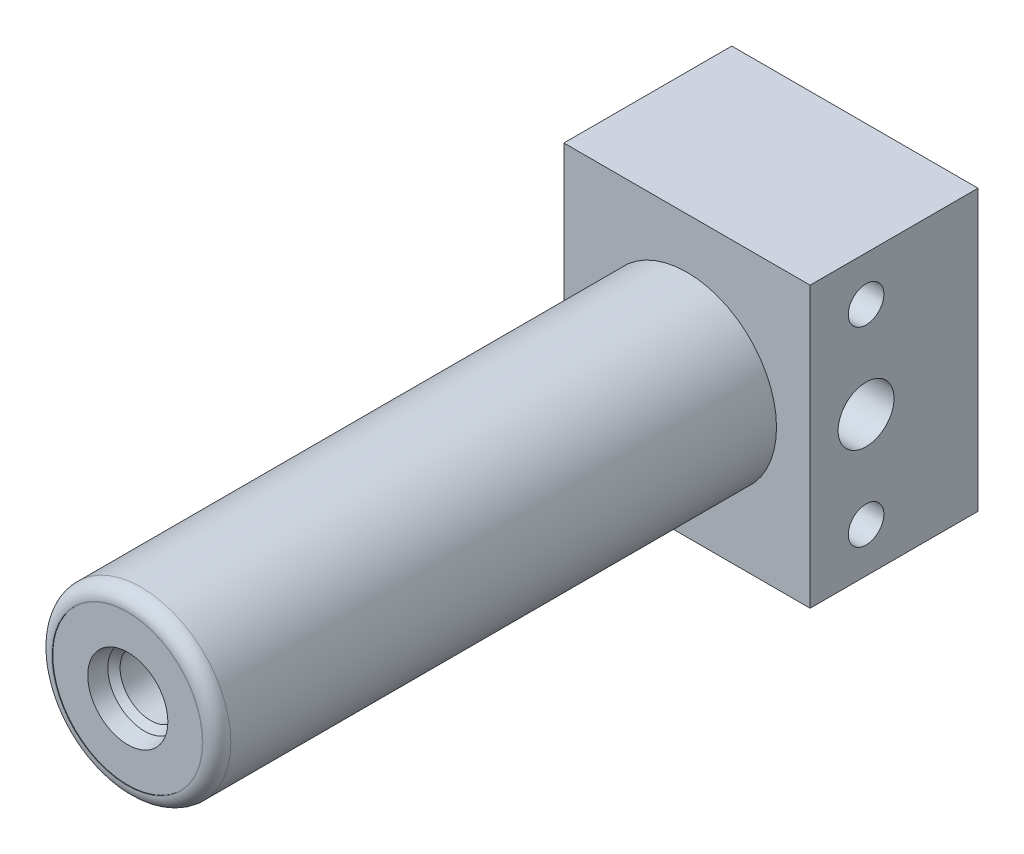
ISO-10303-21;
HEADER;
FILE_DESCRIPTION(('STEP AP214'),'2;1');
FILE_NAME('part.step','',(''),(''),'','','');
FILE_SCHEMA(('AUTOMOTIVE_DESIGN { 1 0 10303 214 1 1 1 1 }'));
ENDSEC;
DATA;
#1=APPLICATION_CONTEXT('core data for automotive mechanical design processes');
#2=APPLICATION_PROTOCOL_DEFINITION('international standard','automotive_design',2000,#1);
#3=PRODUCT_CONTEXT('',#1,'mechanical');
#4=PRODUCT('Part','Part','',(#3));
#5=PRODUCT_RELATED_PRODUCT_CATEGORY('part','',(#4));
#6=PRODUCT_DEFINITION_FORMATION('','',#4);
#7=PRODUCT_DEFINITION_CONTEXT('part definition',#1,'design');
#8=PRODUCT_DEFINITION('design','',#6,#7);
#9=PRODUCT_DEFINITION_SHAPE('','',#8);
#10=(LENGTH_UNIT() NAMED_UNIT(*) SI_UNIT(.MILLI.,.METRE.));
#11=(NAMED_UNIT(*) PLANE_ANGLE_UNIT() SI_UNIT($,.RADIAN.));
#12=(NAMED_UNIT(*) SI_UNIT($,.STERADIAN.) SOLID_ANGLE_UNIT());
#13=UNCERTAINTY_MEASURE_WITH_UNIT(LENGTH_MEASURE(1.E-05),#10,'distance_accuracy_value','');
#14=(GEOMETRIC_REPRESENTATION_CONTEXT(3) GLOBAL_UNCERTAINTY_ASSIGNED_CONTEXT((#13)) GLOBAL_UNIT_ASSIGNED_CONTEXT((#10,
#11,#12)) REPRESENTATION_CONTEXT('',''));
#15=CARTESIAN_POINT('',(0.,0.,0.));
#16=DIRECTION('',(0.,0.,1.));
#17=DIRECTION('',(1.,0.,0.));
#18=AXIS2_PLACEMENT_3D('',#15,#16,#17);
#19=CARTESIAN_POINT('',(-1.27000000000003,0.,12.7));
#20=DIRECTION('',(1.,0.,0.));
#21=DIRECTION('',(0.,0.,-1.));
#22=AXIS2_PLACEMENT_3D('',#19,#20,#21);
#23=CYLINDRICAL_SURFACE('',#22,2.38125);
#24=CARTESIAN_POINT('',(5.71499999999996,0.,10.31875));
#25=CARTESIAN_POINT('',(5.71499259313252,0.12756449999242,10.3187597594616));
#26=CARTESIAN_POINT('',(5.71068086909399,0.255313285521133,10.3290587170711));
#27=CARTESIAN_POINT('',(5.69385664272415,0.507198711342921,10.369879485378));
#28=CARTESIAN_POINT('',(5.68132274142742,0.631325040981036,10.4004540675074));
#29=CARTESIAN_POINT('',(5.64939751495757,0.871897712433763,10.4805053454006));
#30=CARTESIAN_POINT('',(5.63002943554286,0.988368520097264,10.5299180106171));
#31=CARTESIAN_POINT('',(5.58632265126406,1.21125550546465,10.6459773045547));
#32=CARTESIAN_POINT('',(5.56198545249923,1.31767471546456,10.7126187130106));
#33=CARTESIAN_POINT('',(5.50940914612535,1.52294926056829,10.864778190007));
#34=CARTESIAN_POINT('',(5.4810422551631,1.62123362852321,10.9510219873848));
#35=CARTESIAN_POINT('',(5.42415819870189,1.80243444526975,11.1384035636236));
#36=CARTESIAN_POINT('',(5.39564096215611,1.88534280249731,11.2395491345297));
#37=CARTESIAN_POINT('',(5.34011546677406,2.03746870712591,11.4598960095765));
#38=CARTESIAN_POINT('',(5.31325049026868,2.10581192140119,11.579740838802));
#39=CARTESIAN_POINT('',(5.26609765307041,2.22111456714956,11.8305070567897));
#40=CARTESIAN_POINT('',(5.24580640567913,2.26808501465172,11.9614226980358));
#41=CARTESIAN_POINT('',(5.21548148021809,2.33695109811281,12.2240427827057));
#42=CARTESIAN_POINT('',(5.20500078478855,2.35994558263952,12.3554054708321));
#43=CARTESIAN_POINT('',(5.19419826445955,2.38363524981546,12.6205106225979));
#44=CARTESIAN_POINT('',(5.19387083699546,2.38434273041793,12.7542517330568));
#45=CARTESIAN_POINT('',(5.20303352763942,2.36426597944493,13.0093721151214));
#46=CARTESIAN_POINT('',(5.21177296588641,2.34512512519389,13.1309130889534));
#47=CARTESIAN_POINT('',(5.23681609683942,2.28865158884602,13.3688685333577));
#48=CARTESIAN_POINT('',(5.25312123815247,2.25131542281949,13.4852820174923));
#49=CARTESIAN_POINT('',(5.29182681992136,2.15878331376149,13.7126174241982));
#50=CARTESIAN_POINT('',(5.31434958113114,2.1032242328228,13.8233697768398));
#51=CARTESIAN_POINT('',(5.36292420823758,1.9760801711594,14.0344100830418));
#52=CARTESIAN_POINT('',(5.38897746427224,1.90448887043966,14.1346938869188));
#53=CARTESIAN_POINT('',(5.4443562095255,1.74020981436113,14.330870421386));
#54=CARTESIAN_POINT('',(5.47377216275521,1.64625048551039,14.4256758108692));
#55=CARTESIAN_POINT('',(5.53070407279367,1.44347487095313,14.5985487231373));
#56=CARTESIAN_POINT('',(5.558219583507,1.33465511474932,14.6766123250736));
#57=CARTESIAN_POINT('',(5.60904930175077,1.10194334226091,14.815380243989));
#58=CARTESIAN_POINT('',(5.6322518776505,0.977761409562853,14.8756422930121));
#59=CARTESIAN_POINT('',(5.670984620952,0.719808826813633,14.9740387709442));
#60=CARTESIAN_POINT('',(5.68651902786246,0.586043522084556,15.012185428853));
#61=CARTESIAN_POINT('',(5.7073731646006,0.32180805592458,15.0629924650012));
#62=CARTESIAN_POINT('',(5.71327675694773,0.191664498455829,15.0771120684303));
#63=CARTESIAN_POINT('',(5.71606775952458,-0.0692556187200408,15.0838145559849));
#64=CARTESIAN_POINT('',(5.71295775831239,-0.20003198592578,15.0764036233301));
#65=CARTESIAN_POINT('',(5.69844969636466,-0.451672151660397,15.0413000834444));
#66=CARTESIAN_POINT('',(5.68747060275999,-0.572705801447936,15.0146322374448));
#67=CARTESIAN_POINT('',(5.65877595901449,-0.808449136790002,14.9431980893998));
#68=CARTESIAN_POINT('',(5.64105955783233,-0.92315802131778,14.8984295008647));
#69=CARTESIAN_POINT('',(5.59990505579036,-1.14701764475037,14.7906022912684));
#70=CARTESIAN_POINT('',(5.57630631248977,-1.25588503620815,14.7270187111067));
#71=CARTESIAN_POINT('',(5.5259059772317,-1.46179454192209,14.5839433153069));
#72=CARTESIAN_POINT('',(5.49910304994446,-1.55883169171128,14.504444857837));
#73=CARTESIAN_POINT('',(5.44281527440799,-1.74561518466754,14.3251493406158));
#74=CARTESIAN_POINT('',(5.41327565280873,-1.83434487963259,14.2243076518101));
#75=CARTESIAN_POINT('',(5.35656161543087,-1.99390605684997,14.0086944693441));
#76=CARTESIAN_POINT('',(5.32938773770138,-2.06473347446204,13.8939198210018));
#77=CARTESIAN_POINT('',(5.28030540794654,-2.18724404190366,13.6513299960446));
#78=CARTESIAN_POINT('',(5.25847746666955,-2.23864014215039,13.5233523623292));
#79=CARTESIAN_POINT('',(5.22366917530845,-2.31871673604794,13.2593640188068));
#80=CARTESIAN_POINT('',(5.2106815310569,-2.34741596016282,13.1233600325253));
#81=CARTESIAN_POINT('',(5.19613828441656,-2.37942272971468,12.8584603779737));
#82=CARTESIAN_POINT('',(5.19377963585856,-2.38451479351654,12.7298234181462));
#83=CARTESIAN_POINT('',(5.19862789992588,-2.37392671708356,12.4736043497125));
#84=CARTESIAN_POINT('',(5.20583334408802,-2.35824976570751,12.3460220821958));
#85=CARTESIAN_POINT('',(5.22826395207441,-2.30806759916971,12.1016533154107));
#86=CARTESIAN_POINT('',(5.24310015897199,-2.27447286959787,11.9846407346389));
#87=CARTESIAN_POINT('',(5.27881560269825,-2.19029909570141,11.7578860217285));
#88=CARTESIAN_POINT('',(5.29969653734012,-2.13971527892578,11.6481459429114));
#89=CARTESIAN_POINT('',(5.34670548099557,-2.01949577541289,11.4318493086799));
#90=CARTESIAN_POINT('',(5.37307349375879,-1.94889741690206,11.3258809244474));
#91=CARTESIAN_POINT('',(5.42741528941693,-1.79200381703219,11.1267364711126));
#92=CARTESIAN_POINT('',(5.45538962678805,-1.70570313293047,11.0335648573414));
#93=CARTESIAN_POINT('',(5.51223923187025,-1.5123807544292,10.8556766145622));
#94=CARTESIAN_POINT('',(5.54103172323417,-1.40430768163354,10.7720700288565));
#95=CARTESIAN_POINT('',(5.59422593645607,-1.1746333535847,10.6241231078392));
#96=CARTESIAN_POINT('',(5.61862565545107,-1.05302596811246,10.5597915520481));
#97=CARTESIAN_POINT('',(5.65992920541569,-0.801457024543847,10.4536031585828));
#98=CARTESIAN_POINT('',(5.67695027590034,-0.671666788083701,10.4113923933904));
#99=CARTESIAN_POINT('',(5.6958071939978,-0.472734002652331,10.3651502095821));
#100=CARTESIAN_POINT('',(5.70097875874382,-0.405776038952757,10.3525853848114));
#101=CARTESIAN_POINT('',(5.70897329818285,-0.270902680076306,10.333232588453));
#102=CARTESIAN_POINT('',(5.71179782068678,-0.202987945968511,10.3264408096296));
#103=CARTESIAN_POINT('',(5.71446939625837,-0.089993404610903,10.3200239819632));
#104=CARTESIAN_POINT('',(5.71500261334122,-0.0450081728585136,10.3187465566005));
#105=CARTESIAN_POINT('',(5.71499999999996,0.,10.31875));
#106=B_SPLINE_CURVE_WITH_KNOTS('',3,(#24,#25,#26,#27,#28,#29,#30,#31,#32,#33,#34,#35,#36,#37,
#38,#39,#40,#41,#42,#43,#44,#45,#46,#47,#48,#49,#50,#51,#52,#53,#54,#55,#56,#57,#58,#59,#60,#61,
#62,#63,#64,#65,#66,#67,#68,#69,#70,#71,#72,#73,#74,#75,#76,#77,#78,#79,#80,#81,#82,#83,#84,#85,
#86,#87,#88,#89,#90,#91,#92,#93,#94,#95,#96,#97,#98,#99,#100,#101,#102,#103,#104,#105),
.UNSPECIFIED.,.T.,.F.,(4,2,2,2,2,2,2,2,2,2,2,2,2,2,2,2,2,2,2,2,2,2,2,2,2,2,2,2,2,2,2,2,2,2,2,2,
2,2,2,2,4),(0.,0.382537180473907,0.766073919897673,1.14831847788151,1.53044735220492,
1.93010668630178,2.32997574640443,2.74951935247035,3.1688464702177,3.56797495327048,
3.96688319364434,4.33521149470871,4.7036103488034,5.07984848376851,5.45623519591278,
5.86443088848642,6.2727220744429,6.6904372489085,7.10792122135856,7.49900284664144,
7.88997217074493,8.2615390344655,8.63315284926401,9.01631042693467,9.3996282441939,
9.81034019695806,10.2211453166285,10.6378017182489,11.0541139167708,11.4383796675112,
11.8225864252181,12.1889072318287,12.5553310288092,12.9437871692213,13.3323782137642,
13.7492714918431,14.1663543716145,14.5765429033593,14.7812766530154,14.985875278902,
15.1208446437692),.UNSPECIFIED.);
#107=CARTESIAN_POINT('',(5.71499999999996,0.,10.31875));
#108=VERTEX_POINT('',#107);
#109=EDGE_CURVE('E158',#108,#108,#106,.T.);
#110=ORIENTED_EDGE('',*,*,#109,.F.);
#111=EDGE_LOOP('',(#110));
#112=FACE_BOUND('',#111,.T.);
#113=CARTESIAN_POINT('',(6.34999999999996,0.,12.7));
#114=DIRECTION('',(1.,0.,0.));
#115=DIRECTION('',(0.,0.,-1.));
#116=AXIS2_PLACEMENT_3D('',#113,#114,#115);
#117=CIRCLE('',#116,2.38125);
#118=CARTESIAN_POINT('',(6.34999999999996,0.,10.31875));
#119=VERTEX_POINT('',#118);
#120=EDGE_CURVE('E38',#119,#119,#117,.F.);
#121=ORIENTED_EDGE('',*,*,#120,.F.);
#122=EDGE_LOOP('',(#121));
#123=FACE_BOUND('',#122,.T.);
#124=ADVANCED_FACE('F34',(#112,#123),#23,.F.);
#125=CARTESIAN_POINT('',(0.,0.,57.1499999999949));
#126=DIRECTION('',(0.,0.,1.));
#127=DIRECTION('',(1.,0.,0.));
#128=AXIS2_PLACEMENT_3D('',#125,#126,#127);
#129=CYLINDRICAL_SURFACE('',#128,3.4544);
#130=CARTESIAN_POINT('',(0.,0.,79.9211));
#131=DIRECTION('',(0.,0.,1.));
#132=DIRECTION('',(1.,0.,0.));
#133=AXIS2_PLACEMENT_3D('',#130,#131,#132);
#134=CIRCLE('',#133,3.4544);
#135=CARTESIAN_POINT('',(3.45439999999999,0.,79.9211));
#136=VERTEX_POINT('',#135);
#137=EDGE_CURVE('E161',#136,#136,#134,.T.);
#138=ORIENTED_EDGE('',*,*,#137,.T.);
#139=EDGE_LOOP('',(#138));
#140=FACE_BOUND('',#139,.T.);
#141=CARTESIAN_POINT('',(0.,0.,60.96));
#142=DIRECTION('',(0.,0.,-1.));
#143=DIRECTION('',(-1.,0.,0.));
#144=AXIS2_PLACEMENT_3D('',#141,#142,#143);
#145=CIRCLE('',#144,3.4544);
#146=CARTESIAN_POINT('',(-3.4544,0.,60.96));
#147=VERTEX_POINT('',#146);
#148=EDGE_CURVE('E172',#147,#147,#145,.T.);
#149=ORIENTED_EDGE('',*,*,#148,.T.);
#150=EDGE_LOOP('',(#149));
#151=FACE_BOUND('',#150,.T.);
#152=CARTESIAN_POINT('',(-3.4544,0.,68.42125));
#153=CARTESIAN_POINT('',(-3.45439900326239,-0.118789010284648,68.4212487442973));
#154=CARTESIAN_POINT('',(-3.44821958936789,-0.237583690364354,68.4123105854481));
#155=CARTESIAN_POINT('',(-3.42411041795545,-0.471357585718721,68.3771276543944));
#156=CARTESIAN_POINT('',(-3.40617494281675,-0.586334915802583,68.3508744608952));
#157=CARTESIAN_POINT('',(-3.36030887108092,-0.808732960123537,68.2827166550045));
#158=CARTESIAN_POINT('',(-3.33242679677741,-0.916187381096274,68.2408879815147));
#159=CARTESIAN_POINT('',(-3.26886612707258,-1.1220592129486,68.1434072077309));
#160=CARTESIAN_POINT('',(-3.23318648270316,-1.22047540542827,68.0877532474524));
#161=CARTESIAN_POINT('',(-3.15311607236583,-1.41519041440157,67.9589542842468));
#162=CARTESIAN_POINT('',(-3.10823678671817,-1.51055460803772,67.8847065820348));
#163=CARTESIAN_POINT('',(-3.01537225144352,-1.68834049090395,67.7235332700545));
#164=CARTESIAN_POINT('',(-2.96738246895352,-1.77074266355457,67.636588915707));
#165=CARTESIAN_POINT('',(-2.86373167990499,-1.93463831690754,67.4353970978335));
#166=CARTESIAN_POINT('',(-2.80815510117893,-2.01359044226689,67.3190212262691));
#167=CARTESIAN_POINT('',(-2.70448941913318,-2.15081441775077,67.071636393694));
#168=CARTESIAN_POINT('',(-2.65638765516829,-2.20912145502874,66.9406528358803));
#169=CARTESIAN_POINT('',(-2.58845427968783,-2.28793091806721,66.7077486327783));
#170=CARTESIAN_POINT('',(-2.56447430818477,-2.31453836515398,66.6091178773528));
#171=CARTESIAN_POINT('',(-2.52739170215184,-2.35498172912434,66.4073587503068));
#172=CARTESIAN_POINT('',(-2.51426867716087,-2.36884159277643,66.3042391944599));
#173=CARTESIAN_POINT('',(-2.50095285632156,-2.38290235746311,66.0956605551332));
#174=CARTESIAN_POINT('',(-2.50082696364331,-2.38303258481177,65.9901921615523));
#175=CARTESIAN_POINT('',(-2.51370298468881,-2.36944117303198,65.7809398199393));
#176=CARTESIAN_POINT('',(-2.52671424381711,-2.35570967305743,65.6771571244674));
#177=CARTESIAN_POINT('',(-2.56261849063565,-2.31657191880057,65.4802244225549));
#178=CARTESIAN_POINT('',(-2.58488788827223,-2.29189677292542,65.3868077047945));
#179=CARTESIAN_POINT('',(-2.63656720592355,-2.23225222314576,65.2054147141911));
#180=CARTESIAN_POINT('',(-2.66598273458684,-2.19727472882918,65.1174427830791));
#181=CARTESIAN_POINT('',(-2.74552930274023,-2.09780365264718,64.9044056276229));
#182=CARTESIAN_POINT('',(-2.7985916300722,-2.02734305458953,64.78320568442));
#183=CARTESIAN_POINT('',(-2.90788667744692,-1.86722019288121,64.5556661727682));
#184=CARTESIAN_POINT('',(-2.96412539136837,-1.77752066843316,64.4493561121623));
#185=CARTESIAN_POINT('',(-3.07443020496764,-1.57916895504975,64.2521763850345));
#186=CARTESIAN_POINT('',(-3.12846877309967,-1.4703352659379,64.1614727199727));
#187=CARTESIAN_POINT('',(-3.22828277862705,-1.2358109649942,63.9995759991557));
#188=CARTESIAN_POINT('',(-3.27407527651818,-1.11015611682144,63.9283424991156));
#189=CARTESIAN_POINT('',(-3.34372957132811,-0.874058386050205,63.8220687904));
#190=CARTESIAN_POINT('',(-3.37020272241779,-0.766420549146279,63.782505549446));
#191=CARTESIAN_POINT('',(-3.41304858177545,-0.544693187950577,63.7190245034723));
#192=CARTESIAN_POINT('',(-3.42942814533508,-0.430608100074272,63.6950960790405));
#193=CARTESIAN_POINT('',(-3.45065568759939,-0.198648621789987,63.6641579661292));
#194=CARTESIAN_POINT('',(-3.45546120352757,-0.0807618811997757,63.6572105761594));
#195=CARTESIAN_POINT('',(-3.45294408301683,0.154611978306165,63.6608620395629));
#196=CARTESIAN_POINT('',(-3.44562134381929,0.272099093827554,63.6714610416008));
#197=CARTESIAN_POINT('',(-3.42033463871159,0.496151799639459,63.7084068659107));
#198=CARTESIAN_POINT('',(-3.40302011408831,0.602953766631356,63.7337934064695));
#199=CARTESIAN_POINT('',(-3.35966126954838,0.810431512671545,63.7982676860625));
#200=CARTESIAN_POINT('',(-3.33361533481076,0.911106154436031,63.8373579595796));
#201=CARTESIAN_POINT('',(-3.27234689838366,1.11197083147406,63.9311883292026));
#202=CARTESIAN_POINT('',(-3.23657607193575,1.21153845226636,63.9868945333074));
#203=CARTESIAN_POINT('',(-3.15950328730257,1.40029735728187,64.1106790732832));
#204=CARTESIAN_POINT('',(-3.11819745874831,1.48948129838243,64.1787660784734));
#205=CARTESIAN_POINT('',(-3.02541277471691,1.67087000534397,64.3383776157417));
#206=CARTESIAN_POINT('',(-2.97339606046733,1.7610263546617,64.4319186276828));
#207=CARTESIAN_POINT('',(-2.86983245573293,1.92519094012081,64.6325866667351));
#208=CARTESIAN_POINT('',(-2.81828586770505,1.9991893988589,64.7397218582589));
#209=CARTESIAN_POINT('',(-2.72692094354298,2.12176854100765,64.952944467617));
#210=CARTESIAN_POINT('',(-2.6864379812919,2.17233929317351,65.0575969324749));
#211=CARTESIAN_POINT('',(-2.61456388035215,2.25833747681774,65.2758321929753));
#212=CARTESIAN_POINT('',(-2.58315489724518,2.29379469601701,65.3893968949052));
#213=CARTESIAN_POINT('',(-2.5387865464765,2.34272029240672,65.6022037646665));
#214=CARTESIAN_POINT('',(-2.52351240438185,2.3590127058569,65.7003011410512));
#215=CARTESIAN_POINT('',(-2.5045429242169,2.37914907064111,65.8988358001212));
#216=CARTESIAN_POINT('',(-2.50083513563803,2.38300640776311,65.9992704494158));
#217=CARTESIAN_POINT('',(-2.50558341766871,2.37801141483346,66.1995384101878));
#218=CARTESIAN_POINT('',(-2.51404211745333,2.36915633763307,66.2993715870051));
#219=CARTESIAN_POINT('',(-2.54179191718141,2.33935293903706,66.4957135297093));
#220=CARTESIAN_POINT('',(-2.56109859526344,2.31838722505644,66.5922173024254));
#221=CARTESIAN_POINT('',(-2.61517031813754,2.25740389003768,66.808549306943));
#222=CARTESIAN_POINT('',(-2.65285060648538,2.21353180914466,66.9265482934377));
#223=CARTESIAN_POINT('',(-2.73638887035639,2.10938564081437,67.1518988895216));
#224=CARTESIAN_POINT('',(-2.78225930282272,2.0490864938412,67.2592338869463));
#225=CARTESIAN_POINT('',(-2.87817707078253,1.91209775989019,67.4647086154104));
#226=CARTESIAN_POINT('',(-2.92829406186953,1.83507699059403,67.5625943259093));
#227=CARTESIAN_POINT('',(-3.02744479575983,1.66645012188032,67.7455187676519));
#228=CARTESIAN_POINT('',(-3.0764781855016,1.57483934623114,67.8305533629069));
#229=CARTESIAN_POINT('',(-3.17677142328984,1.36261588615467,67.9981945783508));
#230=CARTESIAN_POINT('',(-3.22723128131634,1.23971100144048,68.0784551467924));
#231=CARTESIAN_POINT('',(-3.29375053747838,1.04349526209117,68.1817145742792));
#232=CARTESIAN_POINT('',(-3.31439363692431,0.976120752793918,68.213276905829));
#233=CARTESIAN_POINT('',(-3.35201697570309,0.837849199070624,68.2702352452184));
#234=CARTESIAN_POINT('',(-3.3689986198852,0.766953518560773,68.2956336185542));
#235=CARTESIAN_POINT('',(-3.40662633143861,0.583581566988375,68.3515390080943));
#236=CARTESIAN_POINT('',(-3.42440239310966,0.469080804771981,68.3775552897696));
#237=CARTESIAN_POINT('',(-3.44828509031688,0.23638656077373,68.4124045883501));
#238=CARTESIAN_POINT('',(-3.45440099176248,0.11819608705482,68.421251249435));
#239=CARTESIAN_POINT('',(-3.4544,0.,68.42125));
#240=B_SPLINE_CURVE_WITH_KNOTS('',3,(#152,#153,#154,#155,#156,#157,#158,#159,#160,#161,#162,
#163,#164,#165,#166,#167,#168,#169,#170,#171,#172,#173,#174,#175,#176,#177,#178,#179,#180,#181,
#182,#183,#184,#185,#186,#187,#188,#189,#190,#191,#192,#193,#194,#195,#196,#197,#198,#199,#200,
#201,#202,#203,#204,#205,#206,#207,#208,#209,#210,#211,#212,#213,#214,#215,#216,#217,#218,#219,
#220,#221,#222,#223,#224,#225,#226,#227,#228,#229,#230,#231,#232,#233,#234,#235,#236,#237,#238,
#239),.UNSPECIFIED.,.T.,.F.,(4,2,2,2,2,2,2,2,2,2,2,2,2,2,2,2,2,2,2,2,2,2,2,2,2,2,2,2,2,2,2,2,2,
2,2,2,2,2,2,2,2,2,2,4),(0.,0.355900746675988,0.711974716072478,1.06633489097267,
1.42074276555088,1.80608526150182,2.19200251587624,2.6435984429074,3.09442092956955,
3.40801493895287,3.7210186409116,4.03563345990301,4.35047224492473,4.64686587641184,
4.9434928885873,5.3908420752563,5.83906561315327,6.29179603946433,6.74357876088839,
7.09518462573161,7.4465514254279,7.79920536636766,8.15186229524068,8.48383146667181,
8.81586206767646,9.17321282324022,9.53081477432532,9.94900619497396,10.3674499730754,
10.7353771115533,11.1025757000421,11.4030833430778,11.7032673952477,12.0035163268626,
12.304197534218,12.6962976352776,13.088999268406,13.4903339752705,13.8917975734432,
14.3544588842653,14.5857444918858,14.816941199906,15.1713472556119,15.5254715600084),.UNSPECIFIED.);
#241=CARTESIAN_POINT('',(-3.4544,0.,68.42125));
#242=VERTEX_POINT('',#241);
#243=EDGE_CURVE('E169',#242,#242,#240,.T.);
#244=ORIENTED_EDGE('',*,*,#243,.F.);
#245=EDGE_LOOP('',(#244));
#246=FACE_BOUND('',#245,.T.);
#247=ADVANCED_FACE('F251',(#140,#151,#246),#129,.F.);
#248=CARTESIAN_POINT('',(13.97,-15.8749999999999,19.05));
#249=DIRECTION('',(0.,0.,1.));
#250=DIRECTION('',(1.,0.,0.));
#251=AXIS2_PLACEMENT_3D('',#248,#249,#250);
#252=PLANE('',#251);
#253=DIRECTION('',(0.,1.,0.));
#254=VECTOR('',#253,1.);
#255=CARTESIAN_POINT('',(13.97,15.875,19.05));
#256=LINE('',#255,#254);
#257=CARTESIAN_POINT('',(13.97,-15.8749999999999,19.05));
#258=VERTEX_POINT('',#257);
#259=CARTESIAN_POINT('',(13.97,15.875,19.05));
#260=VERTEX_POINT('',#259);
#261=EDGE_CURVE('E191',#258,#260,#256,.T.);
#262=ORIENTED_EDGE('',*,*,#261,.T.);
#263=DIRECTION('',(-1.,0.,0.));
#264=VECTOR('',#263,1.);
#265=CARTESIAN_POINT('',(-13.97,15.875,19.05));
#266=LINE('',#265,#264);
#267=CARTESIAN_POINT('',(-13.97,15.875,19.05));
#268=VERTEX_POINT('',#267);
#269=EDGE_CURVE('E85',#260,#268,#266,.T.);
#270=ORIENTED_EDGE('',*,*,#269,.T.);
#271=DIRECTION('',(0.,-1.,0.));
#272=VECTOR('',#271,1.);
#273=CARTESIAN_POINT('',(-13.97,15.875,19.05));
#274=LINE('',#273,#272);
#275=CARTESIAN_POINT('',(-13.97,-15.8750000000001,19.05));
#276=VERTEX_POINT('',#275);
#277=EDGE_CURVE('E194',#268,#276,#274,.T.);
#278=ORIENTED_EDGE('',*,*,#277,.T.);
#279=DIRECTION('',(1.,0.,0.));
#280=VECTOR('',#279,1.);
#281=CARTESIAN_POINT('',(-13.97,-15.8750000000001,19.05));
#282=LINE('',#281,#280);
#283=EDGE_CURVE('E53',#276,#258,#282,.T.);
#284=ORIENTED_EDGE('',*,*,#283,.T.);
#285=EDGE_LOOP('',(#262,#270,#278,#284));
#286=FACE_BOUND('',#285,.T.);
#287=CARTESIAN_POINT('',(0.,0.,19.05));
#288=DIRECTION('',(0.,0.,1.));
#289=DIRECTION('',(1.,0.,0.));
#290=AXIS2_PLACEMENT_3D('',#287,#288,#289);
#291=CIRCLE('',#290,10.16);
#292=CARTESIAN_POINT('',(10.16,0.,19.05));
#293=VERTEX_POINT('',#292);
#294=EDGE_CURVE('E187',#293,#293,#291,.T.);
#295=ORIENTED_EDGE('',*,*,#294,.F.);
#296=EDGE_LOOP('',(#295));
#297=FACE_BOUND('',#296,.T.);
#298=ADVANCED_FACE('F255',(#286,#297),#252,.T.);
#299=CARTESIAN_POINT('',(13.97,15.875,19.05));
#300=DIRECTION('',(-1.,0.,0.));
#301=DIRECTION('',(0.,0.,1.));
#302=AXIS2_PLACEMENT_3D('',#299,#300,#301);
#303=PLANE('',#302);
#304=CARTESIAN_POINT('',(13.97,10.81405,12.7));
#305=DIRECTION('',(1.,0.,0.));
#306=DIRECTION('',(0.,0.,-1.));
#307=AXIS2_PLACEMENT_3D('',#304,#305,#306);
#308=CIRCLE('',#307,2.01929999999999);
#309=CARTESIAN_POINT('',(13.97,10.81405,10.6807));
#310=VERTEX_POINT('',#309);
#311=EDGE_CURVE('E113',#310,#310,#308,.T.);
#312=ORIENTED_EDGE('',*,*,#311,.F.);
#313=EDGE_LOOP('',(#312));
#314=FACE_BOUND('',#313,.T.);
#315=CARTESIAN_POINT('',(13.97,-10.81405,12.7));
#316=DIRECTION('',(1.,0.,0.));
#317=DIRECTION('',(0.,0.,-1.));
#318=AXIS2_PLACEMENT_3D('',#315,#316,#317);
#319=CIRCLE('',#318,2.01929999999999);
#320=CARTESIAN_POINT('',(13.97,-10.81405,10.6807));
#321=VERTEX_POINT('',#320);
#322=EDGE_CURVE('E121',#321,#321,#319,.T.);
#323=ORIENTED_EDGE('',*,*,#322,.F.);
#324=EDGE_LOOP('',(#323));
#325=FACE_BOUND('',#324,.T.);
#326=CARTESIAN_POINT('',(13.97,0.,12.7));
#327=DIRECTION('',(1.,0.,0.));
#328=DIRECTION('',(0.,0.,-1.));
#329=AXIS2_PLACEMENT_3D('',#326,#327,#328);
#330=CIRCLE('',#329,3.175);
#331=CARTESIAN_POINT('',(13.97,0.,9.525));
#332=VERTEX_POINT('',#331);
#333=EDGE_CURVE('E148',#332,#332,#330,.T.);
#334=ORIENTED_EDGE('',*,*,#333,.F.);
#335=EDGE_LOOP('',(#334));
#336=FACE_BOUND('',#335,.T.);
#337=DIRECTION('',(0.,1.,0.));
#338=VECTOR('',#337,1.);
#339=CARTESIAN_POINT('',(13.97,15.875,0.));
#340=LINE('',#339,#338);
#341=CARTESIAN_POINT('',(13.97,-15.875,0.));
#342=VERTEX_POINT('',#341);
#343=CARTESIAN_POINT('',(13.97,15.875,0.));
#344=VERTEX_POINT('',#343);
#345=EDGE_CURVE('E190',#342,#344,#340,.T.);
#346=ORIENTED_EDGE('',*,*,#345,.T.);
#347=DIRECTION('',(0.,0.,-1.));
#348=VECTOR('',#347,1.);
#349=CARTESIAN_POINT('',(13.97,15.875,19.05));
#350=LINE('',#349,#348);
#351=EDGE_CURVE('E209',#260,#344,#350,.T.);
#352=ORIENTED_EDGE('',*,*,#351,.F.);
#353=ORIENTED_EDGE('',*,*,#261,.F.);
#354=DIRECTION('',(0.,0.,-1.));
#355=VECTOR('',#354,1.);
#356=CARTESIAN_POINT('',(13.97,-15.8749999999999,19.05));
#357=LINE('',#356,#355);
#358=EDGE_CURVE('E197',#258,#342,#357,.T.);
#359=ORIENTED_EDGE('',*,*,#358,.T.);
#360=EDGE_LOOP('',(#346,#352,#353,#359));
#361=FACE_BOUND('',#360,.T.);
#362=ADVANCED_FACE('F321',(#314,#325,#336,#361),#303,.F.);
#363=CARTESIAN_POINT('',(-13.97,15.875,19.05));
#364=DIRECTION('',(0.,-1.,0.));
#365=DIRECTION('',(0.,0.,-1.));
#366=AXIS2_PLACEMENT_3D('',#363,#364,#365);
#367=PLANE('',#366);
#368=DIRECTION('',(-1.,0.,0.));
#369=VECTOR('',#368,1.);
#370=CARTESIAN_POINT('',(-13.97,15.875,0.));
#371=LINE('',#370,#369);
#372=CARTESIAN_POINT('',(-13.97,15.875,0.));
#373=VERTEX_POINT('',#372);
#374=EDGE_CURVE('E200',#344,#373,#371,.T.);
#375=ORIENTED_EDGE('',*,*,#374,.T.);
#376=DIRECTION('',(0.,0.,-1.));
#377=VECTOR('',#376,1.);
#378=CARTESIAN_POINT('',(-13.97,15.875,19.05));
#379=LINE('',#378,#377);
#380=EDGE_CURVE('E207',#268,#373,#379,.T.);
#381=ORIENTED_EDGE('',*,*,#380,.F.);
#382=ORIENTED_EDGE('',*,*,#269,.F.);
#383=ORIENTED_EDGE('',*,*,#351,.T.);
#384=EDGE_LOOP('',(#375,#381,#382,#383));
#385=FACE_BOUND('',#384,.T.);
#386=ADVANCED_FACE('F324',(#385),#367,.F.);
#387=CARTESIAN_POINT('',(-13.97,15.875,19.05));
#388=DIRECTION('',(1.,0.,0.));
#389=DIRECTION('',(0.,0.,-1.));
#390=AXIS2_PLACEMENT_3D('',#387,#388,#389);
#391=PLANE('',#390);
#392=DIRECTION('',(0.,-1.,0.));
#393=VECTOR('',#392,1.);
#394=CARTESIAN_POINT('',(-13.97,15.875,0.));
#395=LINE('',#394,#393);
#396=CARTESIAN_POINT('',(-13.97,-15.875,0.));
#397=VERTEX_POINT('',#396);
#398=EDGE_CURVE('E71',#373,#397,#395,.T.);
#399=ORIENTED_EDGE('',*,*,#398,.T.);
#400=DIRECTION('',(0.,0.,-1.));
#401=VECTOR('',#400,1.);
#402=CARTESIAN_POINT('',(-13.97,-15.8750000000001,19.05));
#403=LINE('',#402,#401);
#404=EDGE_CURVE('E205',#276,#397,#403,.T.);
#405=ORIENTED_EDGE('',*,*,#404,.F.);
#406=ORIENTED_EDGE('',*,*,#277,.F.);
#407=ORIENTED_EDGE('',*,*,#380,.T.);
#408=EDGE_LOOP('',(#399,#405,#406,#407));
#409=FACE_BOUND('',#408,.T.);
#410=ADVANCED_FACE('F328',(#409),#391,.F.);
#411=CARTESIAN_POINT('',(-13.97,-15.8750000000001,19.05));
#412=DIRECTION('',(0.,1.,0.));
#413=DIRECTION('',(0.,0.,1.));
#414=AXIS2_PLACEMENT_3D('',#411,#412,#413);
#415=PLANE('',#414);
#416=DIRECTION('',(1.,0.,0.));
#417=VECTOR('',#416,1.);
#418=CARTESIAN_POINT('',(-13.97,-15.875,0.));
#419=LINE('',#418,#417);
#420=EDGE_CURVE('E77',#397,#342,#419,.T.);
#421=ORIENTED_EDGE('',*,*,#420,.T.);
#422=ORIENTED_EDGE('',*,*,#358,.F.);
#423=ORIENTED_EDGE('',*,*,#283,.F.);
#424=ORIENTED_EDGE('',*,*,#404,.T.);
#425=EDGE_LOOP('',(#421,#422,#423,#424));
#426=FACE_BOUND('',#425,.T.);
#427=ADVANCED_FACE('F331',(#426),#415,.F.);
#428=CARTESIAN_POINT('',(13.97,-15.875,0.));
#429=DIRECTION('',(0.,0.,1.));
#430=DIRECTION('',(1.,0.,0.));
#431=AXIS2_PLACEMENT_3D('',#428,#429,#430);
#432=PLANE('',#431);
#433=CARTESIAN_POINT('',(-8.98025612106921,8.98025612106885,0.));
#434=DIRECTION('',(0.,0.,-1.));
#435=DIRECTION('',(-1.,0.,0.));
#436=AXIS2_PLACEMENT_3D('',#433,#434,#435);
#437=CIRCLE('',#436,2.01929999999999);
#438=CARTESIAN_POINT('',(-10.9995561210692,8.98025612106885,0.));
#439=VERTEX_POINT('',#438);
#440=EDGE_CURVE('E127',#439,#439,#437,.T.);
#441=ORIENTED_EDGE('',*,*,#440,.F.);
#442=EDGE_LOOP('',(#441));
#443=FACE_BOUND('',#442,.T.);
#444=CARTESIAN_POINT('',(-8.98025612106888,-8.98025612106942,0.));
#445=DIRECTION('',(0.,0.,-1.));
#446=DIRECTION('',(-1.,0.,0.));
#447=AXIS2_PLACEMENT_3D('',#444,#445,#446);
#448=CIRCLE('',#447,2.01929999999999);
#449=CARTESIAN_POINT('',(-10.9995561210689,-8.98025612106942,0.));
#450=VERTEX_POINT('',#449);
#451=EDGE_CURVE('E133',#450,#450,#448,.T.);
#452=ORIENTED_EDGE('',*,*,#451,.F.);
#453=EDGE_LOOP('',(#452));
#454=FACE_BOUND('',#453,.T.);
#455=CARTESIAN_POINT('',(8.98025612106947,-8.98025612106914,0.));
#456=DIRECTION('',(0.,0.,-1.));
#457=DIRECTION('',(-1.,0.,0.));
#458=AXIS2_PLACEMENT_3D('',#455,#456,#457);
#459=CIRCLE('',#458,2.01929999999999);
#460=CARTESIAN_POINT('',(6.96095612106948,-8.98025612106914,0.));
#461=VERTEX_POINT('',#460);
#462=EDGE_CURVE('E139',#461,#461,#459,.T.);
#463=ORIENTED_EDGE('',*,*,#462,.F.);
#464=EDGE_LOOP('',(#463));
#465=FACE_BOUND('',#464,.T.);
#466=CARTESIAN_POINT('',(8.98025612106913,8.98025612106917,0.));
#467=DIRECTION('',(0.,0.,-1.));
#468=DIRECTION('',(-1.,0.,0.));
#469=AXIS2_PLACEMENT_3D('',#466,#467,#468);
#470=CIRCLE('',#469,2.01929999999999);
#471=CARTESIAN_POINT('',(6.96095612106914,8.98025612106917,0.));
#472=VERTEX_POINT('',#471);
#473=EDGE_CURVE('E145',#472,#472,#470,.T.);
#474=ORIENTED_EDGE('',*,*,#473,.F.);
#475=EDGE_LOOP('',(#474));
#476=FACE_BOUND('',#475,.T.);
#477=CARTESIAN_POINT('',(0.,0.,0.));
#478=DIRECTION('',(0.,0.,1.));
#479=DIRECTION('',(1.,0.,0.));
#480=AXIS2_PLACEMENT_3D('',#477,#478,#479);
#481=CIRCLE('',#480,7.40963637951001);
#482=CARTESIAN_POINT('',(7.40963637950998,0.,0.));
#483=VERTEX_POINT('',#482);
#484=EDGE_CURVE('E12',#483,#483,#481,.T.);
#485=ORIENTED_EDGE('',*,*,#484,.T.);
#486=EDGE_LOOP('',(#485));
#487=FACE_BOUND('',#486,.T.);
#488=ORIENTED_EDGE('',*,*,#345,.F.);
#489=ORIENTED_EDGE('',*,*,#420,.F.);
#490=ORIENTED_EDGE('',*,*,#398,.F.);
#491=ORIENTED_EDGE('',*,*,#374,.F.);
#492=EDGE_LOOP('',(#488,#489,#490,#491));
#493=FACE_BOUND('',#492,.T.);
#494=ADVANCED_FACE('F334',(#443,#454,#465,#476,#487,#493),#432,.F.);
#495=CARTESIAN_POINT('',(-2.28983498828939E-13,0.,193.836819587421));
#496=DIRECTION('',(0.,0.,-1.));
#497=DIRECTION('',(-1.,0.,0.));
#498=AXIS2_PLACEMENT_3D('',#495,#496,#497);
#499=CYLINDRICAL_SURFACE('',#498,10.16);
#500=CARTESIAN_POINT('',(0.,0.,80.9625));
#501=DIRECTION('',(0.,0.,1.));
#502=DIRECTION('',(1.,0.,0.));
#503=AXIS2_PLACEMENT_3D('',#500,#501,#502);
#504=CIRCLE('',#503,10.16);
#505=CARTESIAN_POINT('',(10.16,0.,80.9625));
#506=VERTEX_POINT('',#505);
#507=EDGE_CURVE('E249',#506,#506,#504,.F.);
#508=ORIENTED_EDGE('',*,*,#507,.T.);
#509=EDGE_LOOP('',(#508));
#510=FACE_BOUND('',#509,.T.);
#511=CARTESIAN_POINT('',(-10.16,0.,69.215));
#512=CARTESIAN_POINT('',(-10.1599991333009,-0.173835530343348,69.2149988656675));
#513=CARTESIAN_POINT('',(-10.1554964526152,-0.347682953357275,69.2006763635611));
#514=CARTESIAN_POINT('',(-10.1379755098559,-0.690293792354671,69.1439149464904));
#515=CARTESIAN_POINT('',(-10.1249553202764,-0.859056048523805,69.1014696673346));
#516=CARTESIAN_POINT('',(-10.0918217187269,-1.18650650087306,68.9900337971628));
#517=CARTESIAN_POINT('',(-10.0717192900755,-1.34520984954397,68.9210842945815));
#518=CARTESIAN_POINT('',(-10.026496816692,-1.64880239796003,68.7587720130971));
#519=CARTESIAN_POINT('',(-10.0013759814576,-1.79368941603,68.6654053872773));
#520=CARTESIAN_POINT('',(-9.94791542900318,-2.0700119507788,68.4538737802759));
#521=CARTESIAN_POINT('',(-9.91950558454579,-2.20096087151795,68.3350909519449));
#522=CARTESIAN_POINT('',(-9.86307517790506,-2.441441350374,68.0774142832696));
#523=CARTESIAN_POINT('',(-9.83505468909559,-2.55096892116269,67.9385167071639));
#524=CARTESIAN_POINT('',(-9.78182307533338,-2.74813614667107,67.6403408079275));
#525=CARTESIAN_POINT('',(-9.75669850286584,-2.83516791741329,67.4806436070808));
#526=CARTESIAN_POINT('',(-9.71315816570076,-2.98093742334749,67.147967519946));
#527=CARTESIAN_POINT('',(-9.69474063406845,-3.03968261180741,66.9749921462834));
#528=CARTESIAN_POINT('',(-9.6674332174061,-3.12543088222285,66.6261606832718));
#529=CARTESIAN_POINT('',(-9.65827311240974,-3.15333659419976,66.4505482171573));
#530=CARTESIAN_POINT('',(-9.64971540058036,-3.1794336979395,66.0969134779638));
#531=CARTESIAN_POINT('',(-9.65031519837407,-3.17763298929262,65.918891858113));
#532=CARTESIAN_POINT('',(-9.66097100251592,-3.14507434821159,65.5729588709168));
#533=CARTESIAN_POINT('',(-9.67065228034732,-3.11546386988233,65.4049260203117));
#534=CARTESIAN_POINT('',(-9.69777145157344,-3.0299866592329,65.0763439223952));
#535=CARTESIAN_POINT('',(-9.71521016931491,-2.97411713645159,64.9157954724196));
#536=CARTESIAN_POINT('',(-9.75616651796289,-2.83689741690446,64.6040060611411));
#537=CARTESIAN_POINT('',(-9.7797692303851,-2.75518691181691,64.4529353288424));
#538=CARTESIAN_POINT('',(-9.83035515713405,-2.56885492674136,64.1662730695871));
#539=CARTESIAN_POINT('',(-9.85733924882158,-2.46422749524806,64.0306855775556));
#540=CARTESIAN_POINT('',(-9.91315080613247,-2.22940106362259,63.7723516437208));
#541=CARTESIAN_POINT('',(-9.94200626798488,-2.09825480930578,63.6504707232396));
#542=CARTESIAN_POINT('',(-9.99722589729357,-1.81702559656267,63.4302213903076));
#543=CARTESIAN_POINT('',(-10.0235898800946,-1.6669412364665,63.3318547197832));
#544=CARTESIAN_POINT('',(-10.0711328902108,-1.35042811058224,63.1608396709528));
#545=CARTESIAN_POINT('',(-10.0922699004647,-1.18388106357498,63.0883977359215));
#546=CARTESIAN_POINT('',(-10.1266740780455,-0.84015066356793,62.972815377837));
#547=CARTESIAN_POINT('',(-10.1399436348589,-0.6629705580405,62.9296660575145));
#548=CARTESIAN_POINT('',(-10.1567332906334,-0.310350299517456,62.8753681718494));
#549=CARTESIAN_POINT('',(-10.1606101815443,-0.135107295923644,62.8630478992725));
#550=CARTESIAN_POINT('',(-10.1592329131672,0.21496097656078,62.8674542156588));
#551=CARTESIAN_POINT('',(-10.1539800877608,0.389786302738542,62.8841765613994));
#552=CARTESIAN_POINT('',(-10.135168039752,0.729537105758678,62.9452528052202));
#553=CARTESIAN_POINT('',(-10.1218185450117,0.894600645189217,62.9889094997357));
#554=CARTESIAN_POINT('',(-10.0883750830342,1.21501389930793,63.1017644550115));
#555=CARTESIAN_POINT('',(-10.0682802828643,1.37036241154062,63.1709658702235));
#556=CARTESIAN_POINT('',(-10.0228029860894,1.67114831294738,63.3348319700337));
#557=CARTESIAN_POINT('',(-9.99730352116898,1.81625173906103,63.4300763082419));
#558=CARTESIAN_POINT('',(-9.94393261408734,2.08880926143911,63.6426291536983));
#559=CARTESIAN_POINT('',(-9.91606052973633,2.21625855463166,63.7599436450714));
#560=CARTESIAN_POINT('',(-9.85969567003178,2.45513215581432,64.0188175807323));
#561=CARTESIAN_POINT('',(-9.83122206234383,2.56572136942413,64.1611535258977));
#562=CARTESIAN_POINT('',(-9.77803345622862,2.76151975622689,64.4629816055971));
#563=CARTESIAN_POINT('',(-9.75331839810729,2.84672933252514,64.6224734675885));
#564=CARTESIAN_POINT('',(-9.71071927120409,2.9888201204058,64.953756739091));
#565=CARTESIAN_POINT('',(-9.69280881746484,3.04581101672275,65.1254975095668));
#566=CARTESIAN_POINT('',(-9.66599973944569,3.12986151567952,65.4768121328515));
#567=CARTESIAN_POINT('',(-9.65709768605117,3.15693250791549,65.6563829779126));
#568=CARTESIAN_POINT('',(-9.64967063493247,3.17955691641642,66.0095303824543));
#569=CARTESIAN_POINT('',(-9.65069455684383,3.17648030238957,66.1830107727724));
#570=CARTESIAN_POINT('',(-9.66190829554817,3.1422039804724,66.5268534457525));
#571=CARTESIAN_POINT('',(-9.67209768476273,3.11100558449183,66.6972158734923));
#572=CARTESIAN_POINT('',(-9.70017908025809,3.02228833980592,67.0275368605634));
#573=CARTESIAN_POINT('',(-9.71795613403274,2.96516151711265,67.1876112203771));
#574=CARTESIAN_POINT('',(-9.75918048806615,2.82651777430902,67.4960306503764));
#575=CARTESIAN_POINT('',(-9.78262894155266,2.74499589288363,67.6443733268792));
#576=CARTESIAN_POINT('',(-9.83369857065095,2.55614614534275,67.9314007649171));
#577=CARTESIAN_POINT('',(-9.86144710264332,2.44793347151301,68.0694806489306));
#578=CARTESIAN_POINT('',(-9.91740457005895,2.21033085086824,68.3259652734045));
#579=CARTESIAN_POINT('',(-9.94561362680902,2.08093523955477,68.4443647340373));
#580=CARTESIAN_POINT('',(-10.0004187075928,1.79955612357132,68.6619976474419));
#581=CARTESIAN_POINT('',(-10.0269319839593,1.646973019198,68.7604790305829));
#582=CARTESIAN_POINT('',(-10.0743199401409,1.32658901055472,68.9302632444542));
#583=CARTESIAN_POINT('',(-10.0951968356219,1.15879412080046,69.0015767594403));
#584=CARTESIAN_POINT('',(-10.1275045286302,0.82739899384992,69.1098220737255));
#585=CARTESIAN_POINT('',(-10.1395845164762,0.664642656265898,69.1491501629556));
#586=CARTESIAN_POINT('',(-10.1558318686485,0.334593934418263,69.201737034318));
#587=CARTESIAN_POINT('',(-10.1600008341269,0.167302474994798,69.2150010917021));
#588=CARTESIAN_POINT('',(-10.16,0.,69.215));
#589=B_SPLINE_CURVE_WITH_KNOTS('',3,(#511,#512,#513,#514,#515,#516,#517,#518,#519,#520,#521,
#522,#523,#524,#525,#526,#527,#528,#529,#530,#531,#532,#533,#534,#535,#536,#537,#538,#539,#540,
#541,#542,#543,#544,#545,#546,#547,#548,#549,#550,#551,#552,#553,#554,#555,#556,#557,#558,#559,
#560,#561,#562,#563,#564,#565,#566,#567,#568,#569,#570,#571,#572,#573,#574,#575,#576,#577,#578,
#579,#580,#581,#582,#583,#584,#585,#586,#587,#588),.UNSPECIFIED.,.T.,.F.,(4,2,2,2,2,2,2,2,2,2,2,
2,2,2,2,2,2,2,2,2,2,2,2,2,2,2,2,2,2,2,2,2,2,2,2,2,2,2,4),(0.,0.520891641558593,1.04190120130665,
1.56210629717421,2.08239340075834,2.61716068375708,3.15202741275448,3.70011378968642,
4.24805567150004,4.77949641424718,5.31079583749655,5.82109370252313,6.33144580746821,
6.84925332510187,7.36719547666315,7.90871538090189,8.45027538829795,8.99605670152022,
9.54167216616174,10.0662122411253,10.5906756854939,11.102101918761,11.6135913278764,
12.137550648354,12.6616522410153,13.2065211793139,13.7513814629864,14.2941069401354,
14.8366257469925,15.3546099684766,15.8725700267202,16.382947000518,16.893427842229,
17.4238796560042,17.9544735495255,18.5023929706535,19.0500966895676,19.5515137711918,
20.052829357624),.UNSPECIFIED.);
#590=CARTESIAN_POINT('',(-10.16,0.,69.215));
#591=VERTEX_POINT('',#590);
#592=EDGE_CURVE('E183',#591,#591,#589,.T.);
#593=ORIENTED_EDGE('',*,*,#592,.T.);
#594=EDGE_LOOP('',(#593));
#595=FACE_BOUND('',#594,.T.);
#596=ORIENTED_EDGE('',*,*,#294,.T.);
#597=EDGE_LOOP('',(#596));
#598=FACE_BOUND('',#597,.T.);
#599=ADVANCED_FACE('F223',(#510,#595,#598),#499,.T.);
#600=CARTESIAN_POINT('',(13.9699999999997,-15.8749999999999,82.5500000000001));
#601=DIRECTION('',(0.,0.,1.));
#602=DIRECTION('',(1.,0.,0.));
#603=AXIS2_PLACEMENT_3D('',#600,#601,#602);
#604=PLANE('',#603);
#605=CARTESIAN_POINT('',(0.,0.,82.55));
#606=DIRECTION('',(0.,0.,1.));
#607=DIRECTION('',(1.,0.,0.));
#608=AXIS2_PLACEMENT_3D('',#605,#606,#607);
#609=CIRCLE('',#608,8.509);
#610=CARTESIAN_POINT('',(8.50899999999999,0.,82.55));
#611=VERTEX_POINT('',#610);
#612=EDGE_CURVE('E165',#611,#611,#609,.T.);
#613=ORIENTED_EDGE('',*,*,#612,.F.);
#614=EDGE_LOOP('',(#613));
#615=FACE_BOUND('',#614,.T.);
#616=CARTESIAN_POINT('',(0.,0.,82.55));
#617=DIRECTION('',(0.,0.,1.));
#618=DIRECTION('',(1.,0.,0.));
#619=AXIS2_PLACEMENT_3D('',#616,#617,#618);
#620=CIRCLE('',#619,8.5725);
#621=CARTESIAN_POINT('',(8.57249999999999,0.,82.55));
#622=VERTEX_POINT('',#621);
#623=EDGE_CURVE('E211',#622,#622,#620,.T.);
#624=ORIENTED_EDGE('',*,*,#623,.T.);
#625=EDGE_LOOP('',(#624));
#626=FACE_BOUND('',#625,.T.);
#627=ADVANCED_FACE('F299',(#615,#626),#604,.T.);
#628=CARTESIAN_POINT('',(0.,0.,8.128));
#629=DIRECTION('',(0.,0.,-1.));
#630=DIRECTION('',(-1.,0.,0.));
#631=AXIS2_PLACEMENT_3D('',#628,#629,#630);
#632=PLANE('',#631);
#633=CARTESIAN_POINT('',(0.,0.,8.128));
#634=DIRECTION('',(0.,0.,-1.));
#635=DIRECTION('',(-1.,0.,0.));
#636=AXIS2_PLACEMENT_3D('',#633,#634,#635);
#637=CIRCLE('',#636,7.1374);
#638=CARTESIAN_POINT('',(-7.13740000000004,0.,8.128));
#639=VERTEX_POINT('',#638);
#640=EDGE_CURVE('E179',#639,#639,#637,.T.);
#641=ORIENTED_EDGE('',*,*,#640,.T.);
#642=EDGE_LOOP('',(#641));
#643=FACE_BOUND('',#642,.T.);
#644=CARTESIAN_POINT('',(0.,0.,8.12800000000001));
#645=DIRECTION('',(0.,0.,-1.));
#646=DIRECTION('',(-1.,0.,0.));
#647=AXIS2_PLACEMENT_3D('',#644,#645,#646);
#648=CIRCLE('',#647,5.715);
#649=CARTESIAN_POINT('',(-5.71500000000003,0.,8.12800000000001));
#650=VERTEX_POINT('',#649);
#651=EDGE_CURVE('E182',#650,#650,#648,.F.);
#652=ORIENTED_EDGE('',*,*,#651,.T.);
#653=EDGE_LOOP('',(#652));
#654=FACE_BOUND('',#653,.T.);
#655=ADVANCED_FACE('F242',(#643,#654),#632,.T.);
#656=CARTESIAN_POINT('',(0.,0.,8.128));
#657=DIRECTION('',(0.,0.,-1.));
#658=DIRECTION('',(-1.,0.,0.));
#659=AXIS2_PLACEMENT_3D('',#656,#657,#658);
#660=CYLINDRICAL_SURFACE('',#659,7.1374);
#661=CARTESIAN_POINT('',(0.,0.,1.01599999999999));
#662=DIRECTION('',(0.,0.,1.));
#663=DIRECTION('',(1.,0.,0.));
#664=AXIS2_PLACEMENT_3D('',#661,#662,#663);
#665=CIRCLE('',#664,7.1374);
#666=CARTESIAN_POINT('',(7.13739999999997,0.,1.01599999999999));
#667=VERTEX_POINT('',#666);
#668=EDGE_CURVE('E44',#667,#667,#665,.F.);
#669=ORIENTED_EDGE('',*,*,#668,.T.);
#670=EDGE_LOOP('',(#669));
#671=FACE_BOUND('',#670,.T.);
#672=ORIENTED_EDGE('',*,*,#640,.F.);
#673=EDGE_LOOP('',(#672));
#674=FACE_BOUND('',#673,.T.);
#675=ADVANCED_FACE('F292',(#671,#674),#660,.F.);
#676=CARTESIAN_POINT('',(0.,0.,60.96));
#677=DIRECTION('',(0.,0.,-1.));
#678=DIRECTION('',(-1.,0.,0.));
#679=AXIS2_PLACEMENT_3D('',#676,#677,#678);
#680=PLANE('',#679);
#681=ORIENTED_EDGE('',*,*,#148,.F.);
#682=EDGE_LOOP('',(#681));
#683=FACE_BOUND('',#682,.T.);
#684=CARTESIAN_POINT('',(0.,0.,60.96));
#685=DIRECTION('',(0.,0.,-1.));
#686=DIRECTION('',(-1.,0.,0.));
#687=AXIS2_PLACEMENT_3D('',#684,#685,#686);
#688=CIRCLE('',#687,5.715);
#689=CARTESIAN_POINT('',(-5.715,0.,60.96));
#690=VERTEX_POINT('',#689);
#691=EDGE_CURVE('E184',#690,#690,#688,.T.);
#692=ORIENTED_EDGE('',*,*,#691,.T.);
#693=EDGE_LOOP('',(#692));
#694=FACE_BOUND('',#693,.T.);
#695=ADVANCED_FACE('F289',(#683,#694),#680,.T.);
#696=CARTESIAN_POINT('',(0.,0.,60.96));
#697=DIRECTION('',(0.,0.,-1.));
#698=DIRECTION('',(-1.,0.,0.));
#699=AXIS2_PLACEMENT_3D('',#696,#697,#698);
#700=CYLINDRICAL_SURFACE('',#699,5.715);
#701=ORIENTED_EDGE('',*,*,#109,.T.);
#702=EDGE_LOOP('',(#701));
#703=FACE_BOUND('',#702,.T.);
#704=ORIENTED_EDGE('',*,*,#691,.F.);
#705=EDGE_LOOP('',(#704));
#706=FACE_BOUND('',#705,.T.);
#707=ORIENTED_EDGE('',*,*,#651,.F.);
#708=EDGE_LOOP('',(#707));
#709=FACE_BOUND('',#708,.T.);
#710=ADVANCED_FACE('F233',(#703,#706,#709),#700,.F.);
#711=CARTESIAN_POINT('',(-6.34999999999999,0.,66.04));
#712=DIRECTION('',(-1.,0.,0.));
#713=DIRECTION('',(0.,0.,1.));
#714=AXIS2_PLACEMENT_3D('',#711,#712,#713);
#715=CYLINDRICAL_SURFACE('',#714,3.17500000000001);
#716=CARTESIAN_POINT('',(-6.34999999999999,0.,66.04));
#717=DIRECTION('',(-1.,0.,0.));
#718=DIRECTION('',(0.,0.,1.));
#719=AXIS2_PLACEMENT_3D('',#716,#717,#718);
#720=CIRCLE('',#719,3.17500000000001);
#721=CARTESIAN_POINT('',(-6.34999999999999,0.,69.215));
#722=VERTEX_POINT('',#721);
#723=EDGE_CURVE('E175',#722,#722,#720,.T.);
#724=ORIENTED_EDGE('',*,*,#723,.F.);
#725=EDGE_LOOP('',(#724));
#726=FACE_BOUND('',#725,.T.);
#727=ORIENTED_EDGE('',*,*,#592,.F.);
#728=EDGE_LOOP('',(#727));
#729=FACE_BOUND('',#728,.T.);
#730=ADVANCED_FACE('F227',(#726,#729),#715,.F.);
#731=CARTESIAN_POINT('',(-6.34999999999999,0.,66.04));
#732=DIRECTION('',(-1.,0.,0.));
#733=DIRECTION('',(0.,0.,1.));
#734=AXIS2_PLACEMENT_3D('',#731,#732,#733);
#735=PLANE('',#734);
#736=ORIENTED_EDGE('',*,*,#723,.T.);
#737=EDGE_LOOP('',(#736));
#738=FACE_BOUND('',#737,.T.);
#739=CARTESIAN_POINT('',(-6.34999999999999,0.,66.04));
#740=DIRECTION('',(-1.,0.,0.));
#741=DIRECTION('',(0.,0.,1.));
#742=AXIS2_PLACEMENT_3D('',#739,#740,#741);
#743=CIRCLE('',#742,2.38125000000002);
#744=CARTESIAN_POINT('',(-6.34999999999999,0.,68.42125));
#745=VERTEX_POINT('',#744);
#746=EDGE_CURVE('E178',#745,#745,#743,.F.);
#747=ORIENTED_EDGE('',*,*,#746,.T.);
#748=EDGE_LOOP('',(#747));
#749=FACE_BOUND('',#748,.T.);
#750=ADVANCED_FACE('F232',(#738,#749),#735,.T.);
#751=CARTESIAN_POINT('',(1.26999999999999,0.,66.04));
#752=DIRECTION('',(-1.,0.,0.));
#753=DIRECTION('',(0.,0.,1.));
#754=AXIS2_PLACEMENT_3D('',#751,#752,#753);
#755=CYLINDRICAL_SURFACE('',#754,2.38125000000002);
#756=ORIENTED_EDGE('',*,*,#243,.T.);
#757=EDGE_LOOP('',(#756));
#758=FACE_BOUND('',#757,.T.);
#759=ORIENTED_EDGE('',*,*,#746,.F.);
#760=EDGE_LOOP('',(#759));
#761=FACE_BOUND('',#760,.T.);
#762=ADVANCED_FACE('F236',(#758,#761),#755,.F.);
#763=CARTESIAN_POINT('',(0.,0.,80.9625));
#764=DIRECTION('',(0.,0.,1.));
#765=DIRECTION('',(1.,0.,0.));
#766=AXIS2_PLACEMENT_3D('',#763,#764,#765);
#767=TOROIDAL_SURFACE('',#766,8.5725,1.5875);
#768=ORIENTED_EDGE('',*,*,#507,.F.);
#769=EDGE_LOOP('',(#768));
#770=FACE_BOUND('',#769,.T.);
#771=ORIENTED_EDGE('',*,*,#623,.F.);
#772=EDGE_LOOP('',(#771));
#773=FACE_BOUND('',#772,.T.);
#774=ADVANCED_FACE('F240',(#770,#773),#767,.T.);
#775=CARTESIAN_POINT('',(0.,0.,82.4992));
#776=DIRECTION('',(0.,0.,1.));
#777=DIRECTION('',(1.,0.,0.));
#778=AXIS2_PLACEMENT_3D('',#775,#776,#777);
#779=PLANE('',#778);
#780=CARTESIAN_POINT('',(0.,0.,82.4992));
#781=DIRECTION('',(0.,0.,1.));
#782=DIRECTION('',(1.,0.,0.));
#783=AXIS2_PLACEMENT_3D('',#780,#781,#782);
#784=CIRCLE('',#783,4.5466);
#785=CARTESIAN_POINT('',(4.54659999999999,0.,82.4992));
#786=VERTEX_POINT('',#785);
#787=EDGE_CURVE('E162',#786,#786,#784,.T.);
#788=ORIENTED_EDGE('',*,*,#787,.F.);
#789=EDGE_LOOP('',(#788));
#790=FACE_BOUND('',#789,.T.);
#791=CARTESIAN_POINT('',(0.,0.,82.4992));
#792=DIRECTION('',(0.,0.,1.));
#793=DIRECTION('',(1.,0.,0.));
#794=AXIS2_PLACEMENT_3D('',#791,#792,#793);
#795=CIRCLE('',#794,8.509);
#796=CARTESIAN_POINT('',(8.50899999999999,0.,82.4992));
#797=VERTEX_POINT('',#796);
#798=EDGE_CURVE('E166',#797,#797,#795,.T.);
#799=ORIENTED_EDGE('',*,*,#798,.T.);
#800=EDGE_LOOP('',(#799));
#801=FACE_BOUND('',#800,.T.);
#802=ADVANCED_FACE('F261',(#790,#801),#779,.T.);
#803=CARTESIAN_POINT('',(0.,0.,82.4992));
#804=DIRECTION('',(0.,0.,1.));
#805=DIRECTION('',(1.,0.,0.));
#806=AXIS2_PLACEMENT_3D('',#803,#804,#805);
#807=CYLINDRICAL_SURFACE('',#806,8.509);
#808=ORIENTED_EDGE('',*,*,#798,.F.);
#809=EDGE_LOOP('',(#808));
#810=FACE_BOUND('',#809,.T.);
#811=ORIENTED_EDGE('',*,*,#612,.T.);
#812=EDGE_LOOP('',(#811));
#813=FACE_BOUND('',#812,.T.);
#814=ADVANCED_FACE('F257',(#810,#813),#807,.F.);
#815=CARTESIAN_POINT('',(0.,0.,82.4992));
#816=DIRECTION('',(0.,0.,1.));
#817=DIRECTION('',(1.,0.,0.));
#818=AXIS2_PLACEMENT_3D('',#815,#816,#817);
#819=CONICAL_SURFACE('',#818,4.5466,0.20943951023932);
#820=CARTESIAN_POINT('',(0.,0.,80.6196));
#821=DIRECTION('',(0.,0.,1.));
#822=DIRECTION('',(1.,0.,0.));
#823=AXIS2_PLACEMENT_3D('',#820,#821,#822);
#824=CIRCLE('',#823,4.14707868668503);
#825=CARTESIAN_POINT('',(4.14707868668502,0.,80.6196));
#826=VERTEX_POINT('',#825);
#827=EDGE_CURVE('E157',#826,#826,#824,.F.);
#828=ORIENTED_EDGE('',*,*,#827,.T.);
#829=EDGE_LOOP('',(#828));
#830=FACE_BOUND('',#829,.T.);
#831=ORIENTED_EDGE('',*,*,#787,.T.);
#832=EDGE_LOOP('',(#831));
#833=FACE_BOUND('',#832,.T.);
#834=ADVANCED_FACE('F260',(#830,#833),#819,.F.);
#835=CARTESIAN_POINT('',(0.,0.,80.6196));
#836=DIRECTION('',(0.,0.,1.));
#837=DIRECTION('',(1.,0.,0.));
#838=AXIS2_PLACEMENT_3D('',#835,#836,#837);
#839=CONICAL_SURFACE('',#838,4.1529,0.78539816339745);
#840=CARTESIAN_POINT('',(0.,0.,80.6196));
#841=DIRECTION('',(0.,0.,1.));
#842=DIRECTION('',(1.,0.,0.));
#843=AXIS2_PLACEMENT_3D('',#840,#841,#842);
#844=CIRCLE('',#843,4.1529);
#845=CARTESIAN_POINT('',(4.15289999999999,0.,80.6196));
#846=VERTEX_POINT('',#845);
#847=EDGE_CURVE('E154',#846,#846,#844,.T.);
#848=ORIENTED_EDGE('',*,*,#847,.T.);
#849=EDGE_LOOP('',(#848));
#850=FACE_BOUND('',#849,.T.);
#851=ORIENTED_EDGE('',*,*,#137,.F.);
#852=EDGE_LOOP('',(#851));
#853=FACE_BOUND('',#852,.T.);
#854=ADVANCED_FACE('F268',(#850,#853),#839,.F.);
#855=CARTESIAN_POINT('',(0.,0.,80.6196));
#856=DIRECTION('',(0.,0.,1.));
#857=DIRECTION('',(1.,0.,0.));
#858=AXIS2_PLACEMENT_3D('',#855,#856,#857);
#859=PLANE('',#858);
#860=ORIENTED_EDGE('',*,*,#847,.F.);
#861=EDGE_LOOP('',(#860));
#862=FACE_BOUND('',#861,.T.);
#863=ORIENTED_EDGE('',*,*,#827,.F.);
#864=EDGE_LOOP('',(#863));
#865=FACE_BOUND('',#864,.T.);
#866=ADVANCED_FACE('F272',(#862,#865),#859,.F.);
#867=CARTESIAN_POINT('',(0.,0.,1.01599999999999));
#868=DIRECTION('',(0.,0.,-1.));
#869=DIRECTION('',(-1.,0.,0.));
#870=AXIS2_PLACEMENT_3D('',#867,#868,#869);
#871=CONICAL_SURFACE('',#870,7.1374,0.261799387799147);
#872=ORIENTED_EDGE('',*,*,#484,.F.);
#873=EDGE_LOOP('',(#872));
#874=FACE_BOUND('',#873,.T.);
#875=ORIENTED_EDGE('',*,*,#668,.F.);
#876=EDGE_LOOP('',(#875));
#877=FACE_BOUND('',#876,.T.);
#878=ADVANCED_FACE('F36',(#874,#877),#871,.F.);
#879=CARTESIAN_POINT('',(6.34999999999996,0.,12.7));
#880=DIRECTION('',(1.,0.,0.));
#881=DIRECTION('',(0.,0.,-1.));
#882=AXIS2_PLACEMENT_3D('',#879,#880,#881);
#883=PLANE('',#882);
#884=CARTESIAN_POINT('',(6.34999999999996,0.,12.7));
#885=DIRECTION('',(1.,0.,0.));
#886=DIRECTION('',(0.,0.,-1.));
#887=AXIS2_PLACEMENT_3D('',#884,#885,#886);
#888=CIRCLE('',#887,3.175);
#889=CARTESIAN_POINT('',(6.34999999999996,0.,9.525));
#890=VERTEX_POINT('',#889);
#891=EDGE_CURVE('E149',#890,#890,#888,.T.);
#892=ORIENTED_EDGE('',*,*,#891,.T.);
#893=EDGE_LOOP('',(#892));
#894=FACE_BOUND('',#893,.T.);
#895=ORIENTED_EDGE('',*,*,#120,.T.);
#896=EDGE_LOOP('',(#895));
#897=FACE_BOUND('',#896,.T.);
#898=ADVANCED_FACE('F396',(#894,#897),#883,.T.);
#899=CARTESIAN_POINT('',(6.34999999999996,0.,12.7));
#900=DIRECTION('',(1.,0.,0.));
#901=DIRECTION('',(0.,0.,-1.));
#902=AXIS2_PLACEMENT_3D('',#899,#900,#901);
#903=CYLINDRICAL_SURFACE('',#902,3.175);
#904=CARTESIAN_POINT('',(6.34999999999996,0.,9.525));
#905=CARTESIAN_POINT('',(6.42937499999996,0.,9.525));
#906=CARTESIAN_POINT('',(6.50874999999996,0.,9.525));
#907=CARTESIAN_POINT('',(6.66749999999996,0.,9.525));
#908=CARTESIAN_POINT('',(6.74687499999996,0.,9.525));
#909=CARTESIAN_POINT('',(6.90562499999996,0.,9.525));
#910=CARTESIAN_POINT('',(6.98499999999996,0.,9.525));
#911=CARTESIAN_POINT('',(7.14374999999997,0.,9.525));
#912=CARTESIAN_POINT('',(7.22312499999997,0.,9.525));
#913=CARTESIAN_POINT('',(7.38187499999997,0.,9.525));
#914=CARTESIAN_POINT('',(7.46124999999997,0.,9.525));
#915=CARTESIAN_POINT('',(7.61999999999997,0.,9.525));
#916=CARTESIAN_POINT('',(7.69937499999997,0.,9.525));
#917=CARTESIAN_POINT('',(7.85812499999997,0.,9.525));
#918=CARTESIAN_POINT('',(7.93749999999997,0.,9.525));
#919=CARTESIAN_POINT('',(8.09624999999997,0.,9.525));
#920=CARTESIAN_POINT('',(8.17562499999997,0.,9.525));
#921=CARTESIAN_POINT('',(8.33437499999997,0.,9.525));
#922=CARTESIAN_POINT('',(8.41374999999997,0.,9.525));
#923=CARTESIAN_POINT('',(8.57249999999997,0.,9.525));
#924=CARTESIAN_POINT('',(8.65187499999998,0.,9.525));
#925=CARTESIAN_POINT('',(8.81062499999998,0.,9.525));
#926=CARTESIAN_POINT('',(8.88999999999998,0.,9.525));
#927=CARTESIAN_POINT('',(9.04874999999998,0.,9.525));
#928=CARTESIAN_POINT('',(9.12812499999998,0.,9.525));
#929=CARTESIAN_POINT('',(9.28687499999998,0.,9.525));
#930=CARTESIAN_POINT('',(9.36624999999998,0.,9.525));
#931=CARTESIAN_POINT('',(9.52499999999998,0.,9.525));
#932=CARTESIAN_POINT('',(9.60437499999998,0.,9.525));
#933=CARTESIAN_POINT('',(9.76312499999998,0.,9.525));
#934=CARTESIAN_POINT('',(9.84249999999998,0.,9.525));
#935=CARTESIAN_POINT('',(10.00125,0.,9.525));
#936=CARTESIAN_POINT('',(10.080625,0.,9.525));
#937=CARTESIAN_POINT('',(10.239375,0.,9.525));
#938=CARTESIAN_POINT('',(10.31875,0.,9.525));
#939=CARTESIAN_POINT('',(10.4775,0.,9.525));
#940=CARTESIAN_POINT('',(10.556875,0.,9.525));
#941=CARTESIAN_POINT('',(10.715625,0.,9.525));
#942=CARTESIAN_POINT('',(10.795,0.,9.525));
#943=CARTESIAN_POINT('',(10.95375,0.,9.525));
#944=CARTESIAN_POINT('',(11.033125,0.,9.525));
#945=CARTESIAN_POINT('',(11.191875,0.,9.525));
#946=CARTESIAN_POINT('',(11.27125,0.,9.525));
#947=CARTESIAN_POINT('',(11.43,0.,9.525));
#948=CARTESIAN_POINT('',(11.509375,0.,9.525));
#949=CARTESIAN_POINT('',(11.668125,0.,9.525));
#950=CARTESIAN_POINT('',(11.7475,0.,9.525));
#951=CARTESIAN_POINT('',(11.90625,0.,9.525));
#952=CARTESIAN_POINT('',(11.985625,0.,9.525));
#953=CARTESIAN_POINT('',(12.144375,0.,9.525));
#954=CARTESIAN_POINT('',(12.22375,0.,9.525));
#955=CARTESIAN_POINT('',(12.3825,0.,9.525));
#956=CARTESIAN_POINT('',(12.461875,0.,9.525));
#957=CARTESIAN_POINT('',(12.620625,0.,9.525));
#958=CARTESIAN_POINT('',(12.7,0.,9.525));
#959=CARTESIAN_POINT('',(12.85875,0.,9.525));
#960=CARTESIAN_POINT('',(12.938125,0.,9.525));
#961=CARTESIAN_POINT('',(13.096875,0.,9.525));
#962=CARTESIAN_POINT('',(13.17625,0.,9.525));
#963=CARTESIAN_POINT('',(13.335,0.,9.525));
#964=CARTESIAN_POINT('',(13.414375,0.,9.525));
#965=CARTESIAN_POINT('',(13.573125,0.,9.525));
#966=CARTESIAN_POINT('',(13.6525,0.,9.525));
#967=CARTESIAN_POINT('',(13.81125,0.,9.525));
#968=CARTESIAN_POINT('',(13.890625,0.,9.525));
#969=CARTESIAN_POINT('',(13.97,0.,9.525));
#970=B_SPLINE_CURVE_WITH_KNOTS('',3,(#904,#905,#906,#907,#908,#909,#910,#911,#912,#913,#914,
#915,#916,#917,#918,#919,#920,#921,#922,#923,#924,#925,#926,#927,#928,#929,#930,#931,#932,#933,
#934,#935,#936,#937,#938,#939,#940,#941,#942,#943,#944,#945,#946,#947,#948,#949,#950,#951,#952,
#953,#954,#955,#956,#957,#958,#959,#960,#961,#962,#963,#964,#965,#966,#967,#968,#969),
.UNSPECIFIED.,.F.,.F.,(4,2,2,2,2,2,2,2,2,2,2,2,2,2,2,2,2,2,2,2,2,2,2,2,2,2,2,2,2,2,2,2,4),(0.,
0.238125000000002,0.476250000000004,0.714375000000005,0.952500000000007,1.19062500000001,
1.42875000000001,1.66687500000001,1.90500000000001,2.14312500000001,2.38125000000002,
2.61937500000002,2.85750000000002,3.09562500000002,3.33375000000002,3.57187500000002,
3.81000000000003,4.04812500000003,4.28625000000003,4.52437500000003,4.76250000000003,
5.00062500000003,5.23875000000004,5.47687500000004,5.71500000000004,5.95312500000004,
6.19125000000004,6.42937500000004,6.66750000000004,6.90562500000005,7.14375000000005,
7.38187500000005,7.62000000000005),.UNSPECIFIED.);
#971=EDGE_CURVE('BSEAM281',#890,#332,#970,.T.);
#972=ORIENTED_EDGE('',*,*,#891,.F.);
#973=ORIENTED_EDGE('',*,*,#333,.T.);
#974=ORIENTED_EDGE('',*,*,#971,.T.);
#975=ORIENTED_EDGE('',*,*,#971,.F.);
#976=EDGE_LOOP('',(#972,#974,#973,#975));
#977=FACE_BOUND('',#976,.T.);
#978=ADVANCED_FACE('F281',(#977),#903,.F.);
#979=CARTESIAN_POINT('',(8.98025612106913,8.98025612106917,0.));
#980=DIRECTION('',(0.,0.,-1.));
#981=DIRECTION('',(-1.,0.,0.));
#982=AXIS2_PLACEMENT_3D('',#979,#980,#981);
#983=CYLINDRICAL_SURFACE('',#982,2.01929999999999);
#984=CARTESIAN_POINT('',(8.98025612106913,8.98025612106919,6.34999999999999));
#985=DIRECTION('',(0.,0.,-1.));
#986=DIRECTION('',(-1.,0.,0.));
#987=AXIS2_PLACEMENT_3D('',#984,#985,#986);
#988=CIRCLE('',#987,2.0193);
#989=CARTESIAN_POINT('',(6.96095612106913,8.98025612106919,6.34999999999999));
#990=VERTEX_POINT('',#989);
#991=EDGE_CURVE('E142',#990,#990,#988,.T.);
#992=ORIENTED_EDGE('',*,*,#991,.F.);
#993=EDGE_LOOP('',(#992));
#994=FACE_BOUND('',#993,.T.);
#995=ORIENTED_EDGE('',*,*,#473,.T.);
#996=EDGE_LOOP('',(#995));
#997=FACE_BOUND('',#996,.T.);
#998=ADVANCED_FACE('F407',(#994,#997),#983,.F.);
#999=CARTESIAN_POINT('',(8.98025612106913,8.98025612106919,6.34999999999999));
#1000=DIRECTION('',(0.,0.,-1.));
#1001=DIRECTION('',(-1.,0.,0.));
#1002=AXIS2_PLACEMENT_3D('',#999,#1000,#1001);
#1003=CONICAL_SURFACE('',#1002,2.0193,1.02974425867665);
#1004=CARTESIAN_POINT('',(8.98025612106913,8.98025612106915,7.56331784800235));
#1005=VERTEX_POINT('',#1004);
#1006=VERTEX_LOOP('',#1005);
#1007=FACE_BOUND('',#1006,.T.);
#1008=ORIENTED_EDGE('',*,*,#991,.T.);
#1009=EDGE_LOOP('',(#1008));
#1010=FACE_BOUND('',#1009,.T.);
#1011=ADVANCED_FACE('F414',(#1007,#1010),#1003,.F.);
#1012=CARTESIAN_POINT('',(8.98025612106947,-8.98025612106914,0.));
#1013=DIRECTION('',(0.,0.,-1.));
#1014=DIRECTION('',(-1.,0.,0.));
#1015=AXIS2_PLACEMENT_3D('',#1012,#1013,#1014);
#1016=CYLINDRICAL_SURFACE('',#1015,2.01929999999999);
#1017=CARTESIAN_POINT('',(8.98025612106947,-8.98025612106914,6.34999999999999));
#1018=DIRECTION('',(0.,0.,-1.));
#1019=DIRECTION('',(-1.,0.,0.));
#1020=AXIS2_PLACEMENT_3D('',#1017,#1018,#1019);
#1021=CIRCLE('',#1020,2.0193);
#1022=CARTESIAN_POINT('',(6.96095612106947,-8.98025612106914,6.34999999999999));
#1023=VERTEX_POINT('',#1022);
#1024=EDGE_CURVE('E136',#1023,#1023,#1021,.T.);
#1025=ORIENTED_EDGE('',*,*,#1024,.F.);
#1026=EDGE_LOOP('',(#1025));
#1027=FACE_BOUND('',#1026,.T.);
#1028=ORIENTED_EDGE('',*,*,#462,.T.);
#1029=EDGE_LOOP('',(#1028));
#1030=FACE_BOUND('',#1029,.T.);
#1031=ADVANCED_FACE('F422',(#1027,#1030),#1016,.F.);
#1032=CARTESIAN_POINT('',(8.98025612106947,-8.98025612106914,6.34999999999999));
#1033=DIRECTION('',(0.,0.,-1.));
#1034=DIRECTION('',(-1.,0.,0.));
#1035=AXIS2_PLACEMENT_3D('',#1032,#1033,#1034);
#1036=CONICAL_SURFACE('',#1035,2.0193,1.02974425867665);
#1037=CARTESIAN_POINT('',(8.98025612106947,-8.98025612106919,7.56331784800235));
#1038=VERTEX_POINT('',#1037);
#1039=VERTEX_LOOP('',#1038);
#1040=FACE_BOUND('',#1039,.T.);
#1041=ORIENTED_EDGE('',*,*,#1024,.T.);
#1042=EDGE_LOOP('',(#1041));
#1043=FACE_BOUND('',#1042,.T.);
#1044=ADVANCED_FACE('F430',(#1040,#1043),#1036,.F.);
#1045=CARTESIAN_POINT('',(-8.98025612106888,-8.98025612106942,0.));
#1046=DIRECTION('',(0.,0.,-1.));
#1047=DIRECTION('',(-1.,0.,0.));
#1048=AXIS2_PLACEMENT_3D('',#1045,#1046,#1047);
#1049=CYLINDRICAL_SURFACE('',#1048,2.01929999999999);
#1050=CARTESIAN_POINT('',(-8.98025612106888,-8.98025612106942,6.34999999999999));
#1051=DIRECTION('',(0.,0.,-1.));
#1052=DIRECTION('',(-1.,0.,0.));
#1053=AXIS2_PLACEMENT_3D('',#1050,#1051,#1052);
#1054=CIRCLE('',#1053,2.0193);
#1055=CARTESIAN_POINT('',(-10.9995561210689,-8.98025612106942,6.34999999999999));
#1056=VERTEX_POINT('',#1055);
#1057=EDGE_CURVE('E130',#1056,#1056,#1054,.T.);
#1058=ORIENTED_EDGE('',*,*,#1057,.F.);
#1059=EDGE_LOOP('',(#1058));
#1060=FACE_BOUND('',#1059,.T.);
#1061=ORIENTED_EDGE('',*,*,#451,.T.);
#1062=EDGE_LOOP('',(#1061));
#1063=FACE_BOUND('',#1062,.T.);
#1064=ADVANCED_FACE('F438',(#1060,#1063),#1049,.F.);
#1065=CARTESIAN_POINT('',(-8.98025612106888,-8.98025612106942,6.34999999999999));
#1066=DIRECTION('',(0.,0.,-1.));
#1067=DIRECTION('',(-1.,0.,0.));
#1068=AXIS2_PLACEMENT_3D('',#1065,#1066,#1067);
#1069=CONICAL_SURFACE('',#1068,2.0193,1.02974425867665);
#1070=CARTESIAN_POINT('',(-8.98025612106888,-8.98025612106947,7.56331784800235));
#1071=VERTEX_POINT('',#1070);
#1072=VERTEX_LOOP('',#1071);
#1073=FACE_BOUND('',#1072,.T.);
#1074=ORIENTED_EDGE('',*,*,#1057,.T.);
#1075=EDGE_LOOP('',(#1074));
#1076=FACE_BOUND('',#1075,.T.);
#1077=ADVANCED_FACE('F446',(#1073,#1076),#1069,.F.);
#1078=CARTESIAN_POINT('',(-8.98025612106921,8.98025612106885,0.));
#1079=DIRECTION('',(0.,0.,-1.));
#1080=DIRECTION('',(-1.,0.,0.));
#1081=AXIS2_PLACEMENT_3D('',#1078,#1079,#1080);
#1082=CYLINDRICAL_SURFACE('',#1081,2.01929999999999);
#1083=CARTESIAN_POINT('',(-8.98025612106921,8.98025612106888,6.35000000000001));
#1084=DIRECTION('',(0.,0.,-1.));
#1085=DIRECTION('',(-1.,0.,0.));
#1086=AXIS2_PLACEMENT_3D('',#1083,#1084,#1085);
#1087=CIRCLE('',#1086,2.0193);
#1088=CARTESIAN_POINT('',(-10.9995561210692,8.98025612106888,6.35000000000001));
#1089=VERTEX_POINT('',#1088);
#1090=EDGE_CURVE('E124',#1089,#1089,#1087,.T.);
#1091=ORIENTED_EDGE('',*,*,#1090,.F.);
#1092=EDGE_LOOP('',(#1091));
#1093=FACE_BOUND('',#1092,.T.);
#1094=ORIENTED_EDGE('',*,*,#440,.T.);
#1095=EDGE_LOOP('',(#1094));
#1096=FACE_BOUND('',#1095,.T.);
#1097=ADVANCED_FACE('F454',(#1093,#1096),#1082,.F.);
#1098=CARTESIAN_POINT('',(-8.98025612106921,8.98025612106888,6.35000000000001));
#1099=DIRECTION('',(0.,0.,-1.));
#1100=DIRECTION('',(-1.,0.,0.));
#1101=AXIS2_PLACEMENT_3D('',#1098,#1099,#1100);
#1102=CONICAL_SURFACE('',#1101,2.0193,1.02974425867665);
#1103=CARTESIAN_POINT('',(-8.98025612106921,8.98025612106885,7.56331784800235));
#1104=VERTEX_POINT('',#1103);
#1105=VERTEX_LOOP('',#1104);
#1106=FACE_BOUND('',#1105,.T.);
#1107=ORIENTED_EDGE('',*,*,#1090,.T.);
#1108=EDGE_LOOP('',(#1107));
#1109=FACE_BOUND('',#1108,.T.);
#1110=ADVANCED_FACE('F462',(#1106,#1109),#1102,.F.);
#1111=CARTESIAN_POINT('',(13.97,-10.81405,12.7));
#1112=DIRECTION('',(1.,0.,0.));
#1113=DIRECTION('',(0.,0.,-1.));
#1114=AXIS2_PLACEMENT_3D('',#1111,#1112,#1113);
#1115=CYLINDRICAL_SURFACE('',#1114,2.01929999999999);
#1116=CARTESIAN_POINT('',(1.26999999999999,-10.81405,12.7));
#1117=DIRECTION('',(1.,0.,0.));
#1118=DIRECTION('',(0.,0.,-1.));
#1119=AXIS2_PLACEMENT_3D('',#1116,#1117,#1118);
#1120=CIRCLE('',#1119,2.0193);
#1121=CARTESIAN_POINT('',(1.26999999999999,-10.81405,10.6807));
#1122=VERTEX_POINT('',#1121);
#1123=EDGE_CURVE('E116',#1122,#1122,#1120,.T.);
#1124=ORIENTED_EDGE('',*,*,#1123,.F.);
#1125=EDGE_LOOP('',(#1124));
#1126=FACE_BOUND('',#1125,.T.);
#1127=ORIENTED_EDGE('',*,*,#322,.T.);
#1128=EDGE_LOOP('',(#1127));
#1129=FACE_BOUND('',#1128,.T.);
#1130=ADVANCED_FACE('F470',(#1126,#1129),#1115,.F.);
#1131=CARTESIAN_POINT('',(1.26999999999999,-10.81405,12.7));
#1132=DIRECTION('',(1.,0.,0.));
#1133=DIRECTION('',(0.,0.,-1.));
#1134=AXIS2_PLACEMENT_3D('',#1131,#1132,#1133);
#1135=CONICAL_SURFACE('',#1134,2.0193,1.02974425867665);
#1136=CARTESIAN_POINT('',(0.0566821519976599,-10.81405,12.7));
#1137=VERTEX_POINT('',#1136);
#1138=VERTEX_LOOP('',#1137);
#1139=FACE_BOUND('',#1138,.T.);
#1140=ORIENTED_EDGE('',*,*,#1123,.T.);
#1141=EDGE_LOOP('',(#1140));
#1142=FACE_BOUND('',#1141,.T.);
#1143=ADVANCED_FACE('F479',(#1139,#1142),#1135,.F.);
#1144=CARTESIAN_POINT('',(13.97,10.81405,12.7));
#1145=DIRECTION('',(1.,0.,0.));
#1146=DIRECTION('',(0.,0.,-1.));
#1147=AXIS2_PLACEMENT_3D('',#1144,#1145,#1146);
#1148=CYLINDRICAL_SURFACE('',#1147,2.01929999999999);
#1149=CARTESIAN_POINT('',(1.26999999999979,10.81405,12.7));
#1150=DIRECTION('',(1.,0.,0.));
#1151=DIRECTION('',(0.,0.,-1.));
#1152=AXIS2_PLACEMENT_3D('',#1149,#1150,#1151);
#1153=CIRCLE('',#1152,2.0193);
#1154=CARTESIAN_POINT('',(1.26999999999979,10.81405,10.6807));
#1155=VERTEX_POINT('',#1154);
#1156=EDGE_CURVE('E111',#1155,#1155,#1153,.T.);
#1157=ORIENTED_EDGE('',*,*,#1156,.F.);
#1158=EDGE_LOOP('',(#1157));
#1159=FACE_BOUND('',#1158,.T.);
#1160=ORIENTED_EDGE('',*,*,#311,.T.);
#1161=EDGE_LOOP('',(#1160));
#1162=FACE_BOUND('',#1161,.T.);
#1163=ADVANCED_FACE('F107',(#1159,#1162),#1148,.F.);
#1164=CARTESIAN_POINT('',(1.26999999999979,10.81405,12.7));
#1165=DIRECTION('',(1.,0.,0.));
#1166=DIRECTION('',(0.,0.,-1.));
#1167=AXIS2_PLACEMENT_3D('',#1164,#1165,#1166);
#1168=CONICAL_SURFACE('',#1167,2.0193,1.02974425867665);
#1169=CARTESIAN_POINT('',(0.0566821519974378,10.81405,12.7));
#1170=VERTEX_POINT('',#1169);
#1171=VERTEX_LOOP('',#1170);
#1172=FACE_BOUND('',#1171,.T.);
#1173=ORIENTED_EDGE('',*,*,#1156,.T.);
#1174=EDGE_LOOP('',(#1173));
#1175=FACE_BOUND('',#1174,.T.);
#1176=ADVANCED_FACE('F104',(#1172,#1175),#1168,.F.);
#1177=CLOSED_SHELL('',(#124,#247,#298,#362,#386,#410,#427,#494,#599,#627,#655,#675,#695,#710,
#730,#750,#762,#774,#802,#814,#834,#854,#866,#878,#898,#978,#998,#1011,#1031,#1044,#1064,#1077,
#1097,#1110,#1130,#1143,#1163,#1176));
#1178=MANIFOLD_SOLID_BREP('B2',#1177);
#1179=ADVANCED_BREP_SHAPE_REPRESENTATION('',(#18,#1178),#14);
#1180=SHAPE_DEFINITION_REPRESENTATION(#9,#1179);
ENDSEC;
END-ISO-10303-21;
